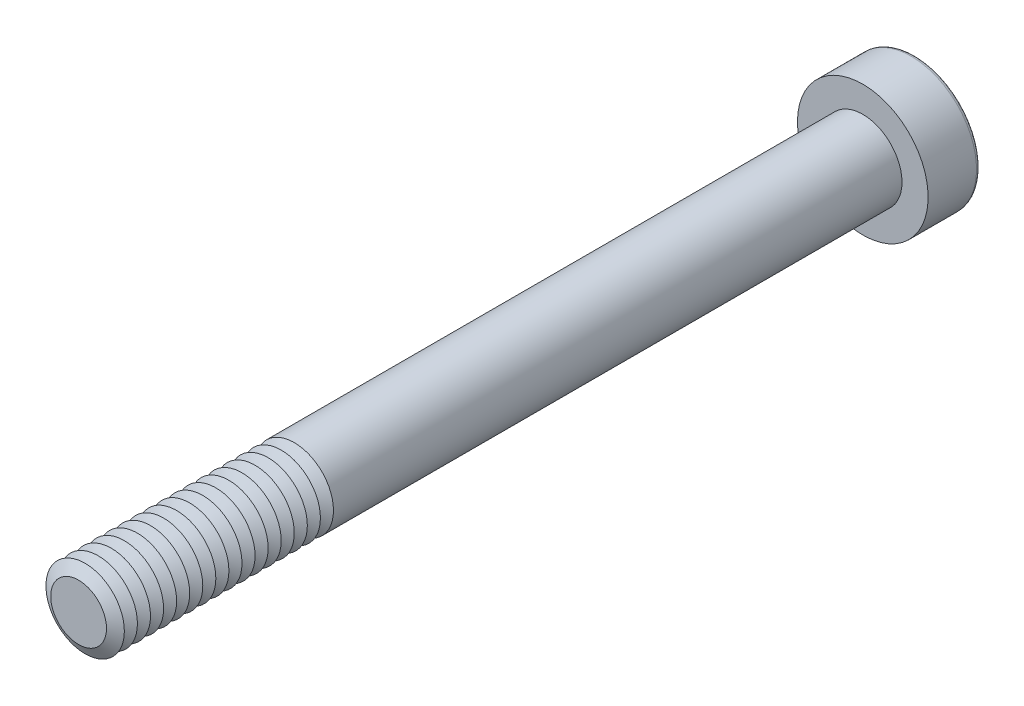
from build123d import *

# Parameters (mm, degrees)
SKETCH1_R           = 3
BOSS_EXTRUDE1_DEPTH = 60
SKETCH2_R           = 5
BOSS_EXTRUDE2_DEPTH = 4
CUT_EXTRUDE1_DEPTH  = 3
FILLET1_R           = 0.3
LPATTERN1_COUNT     = 17
LPATTERN1_PITCH     = 1


with BuildPart() as part:
    # Sketch1 → Boss-Extrude1 (new body)
    with BuildSketch(Plane.XY):
        Circle(SKETCH1_R)
    extrude(amount=BOSS_EXTRUDE1_DEPTH)

    # Sketch2 → Boss-Extrude2 (add)
    with BuildSketch(Plane(origin=(0, 0, 0), x_dir=(-1, 0, 0), z_dir=(0, 0, -1))):
        Circle(SKETCH2_R)
    extrude(amount=BOSS_EXTRUDE2_DEPTH)

    # Sketch3 → Cut-Extrude1 (cut)
    with BuildSketch(Plane(origin=(0, 0, -4), x_dir=(-1, 0, 0), z_dir=(0, 0, -1))):
        Polygon((-1.154700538, 2), (-2.309401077, 0), (-1.154700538, -2), (1.154700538, -2), (2.309401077, 0), (1.154700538, 2), align=None)
    extrude(amount=-CUT_EXTRUDE1_DEPTH, mode=Mode.SUBTRACT)

    # Fillet1
    fillet1_edges = [part.edges().sort_by_distance(p)[0] for p in [
        (5, 0, -4),
    ]]
    fillet(fillet1_edges, radius=FILLET1_R)

    # Cut-Extrude2 cone 1 section (on through the dimple's axis) → Cut-Extrude2 (revolve, cut)
    with BuildSketch(Plane(origin=(0, 0, -1), x_dir=(0, 1, 0), z_dir=(1, 0, 0))):
        Polygon((0, 0), (2, 0), (0, 1.154700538), align=None)
    revolve(axis=Axis((0, 0, -1), (0, 0, 1)), mode=Mode.SUBTRACT)

    # Cut-Extrude3 cone 1 section (on through the dimple's axis) → Cut-Extrude3 (revolve, cut)
    with BuildSketch(Plane(origin=(0, 0, -4), x_dir=(0, 1, 0), z_dir=(1, 0, 0))):
        Polygon((0, 0), (2.309401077, 0), (0, 0.618802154), align=None)
    revolve(axis=Axis((0, 0, -4), (0, 0, 1)), mode=Mode.SUBTRACT)

    # Sketch7 → Cut-Revolve1 (revolve, cut)
    with BuildSketch(Plane(origin=(0, 0, 0), x_dir=(0, 0, -1), z_dir=(1, 0, 0)), mode=Mode.PRIVATE) as cut_revolve1_sk:
        Polygon((-60, 2.133974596), (-59.5, 3), (-60.5, 3), align=None)
    cut_revolve1 = revolve(cut_revolve1_sk.sketch.rotate(Axis((0, 0, 60), (0, 0, -1)), 90), axis=Axis((0, 0, 60), (0, 0, -1)), mode=Mode.SUBTRACT)

    # LPattern1: Cut-Revolve1 ×17
    with Locations(*[(0, 0, -i * LPATTERN1_PITCH) for i in range(1, LPATTERN1_COUNT)]):
        add(cut_revolve1, mode=Mode.SUBTRACT)


solid = part.part
